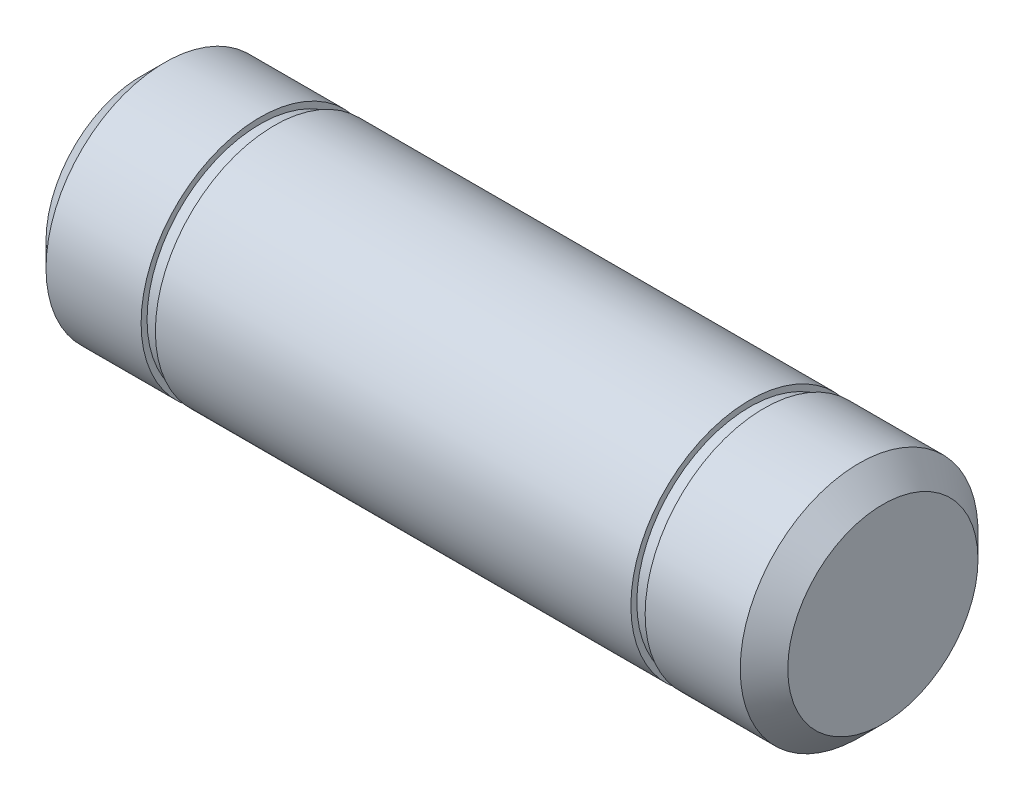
ISO-10303-21;
HEADER;
FILE_DESCRIPTION(('STEP AP214'),'2;1');
FILE_NAME('part.step','',(''),(''),'','','');
FILE_SCHEMA(('AUTOMOTIVE_DESIGN { 1 0 10303 214 1 1 1 1 }'));
ENDSEC;
DATA;
#1=APPLICATION_CONTEXT('core data for automotive mechanical design processes');
#2=APPLICATION_PROTOCOL_DEFINITION('international standard','automotive_design',2000,#1);
#3=PRODUCT_CONTEXT('',#1,'mechanical');
#4=PRODUCT('Part','Part','',(#3));
#5=PRODUCT_RELATED_PRODUCT_CATEGORY('part','',(#4));
#6=PRODUCT_DEFINITION_FORMATION('','',#4);
#7=PRODUCT_DEFINITION_CONTEXT('part definition',#1,'design');
#8=PRODUCT_DEFINITION('design','',#6,#7);
#9=PRODUCT_DEFINITION_SHAPE('','',#8);
#10=(LENGTH_UNIT() NAMED_UNIT(*) SI_UNIT(.MILLI.,.METRE.));
#11=(NAMED_UNIT(*) PLANE_ANGLE_UNIT() SI_UNIT($,.RADIAN.));
#12=(NAMED_UNIT(*) SI_UNIT($,.STERADIAN.) SOLID_ANGLE_UNIT());
#13=UNCERTAINTY_MEASURE_WITH_UNIT(LENGTH_MEASURE(1.E-05),#10,'distance_accuracy_value','');
#14=(GEOMETRIC_REPRESENTATION_CONTEXT(3) GLOBAL_UNCERTAINTY_ASSIGNED_CONTEXT((#13)) GLOBAL_UNIT_ASSIGNED_CONTEXT((#10,
#11,#12)) REPRESENTATION_CONTEXT('',''));
#15=CARTESIAN_POINT('',(0.,0.,0.));
#16=DIRECTION('',(0.,0.,1.));
#17=DIRECTION('',(1.,0.,0.));
#18=AXIS2_PLACEMENT_3D('',#15,#16,#17);
#19=CARTESIAN_POINT('',(-74.8924832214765,5.75154362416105,0.));
#20=DIRECTION('',(1.,0.,0.));
#21=DIRECTION('',(0.,0.,-1.));
#22=AXIS2_PLACEMENT_3D('',#19,#20,#21);
#23=PLANE('',#22);
#24=CARTESIAN_POINT('',(-74.8924832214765,5.75154362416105,0.));
#25=DIRECTION('',(1.,0.,0.));
#26=DIRECTION('',(0.,0.,-1.));
#27=AXIS2_PLACEMENT_3D('',#24,#25,#26);
#28=CIRCLE('',#27,7.99999999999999);
#29=CARTESIAN_POINT('',(-74.8924832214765,5.75154362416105,-7.99999999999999));
#30=VERTEX_POINT('',#29);
#31=EDGE_CURVE('E359',#30,#30,#28,.F.);
#32=ORIENTED_EDGE('',*,*,#31,.T.);
#33=EDGE_LOOP('',(#32));
#34=FACE_BOUND('',#33,.T.);
#35=ADVANCED_FACE('F353',(#34),#23,.F.);
#36=CARTESIAN_POINT('',(-112.89677852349,5.75154362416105,0.));
#37=DIRECTION('',(-1.,0.,0.));
#38=DIRECTION('',(0.,0.,1.));
#39=AXIS2_PLACEMENT_3D('',#36,#37,#38);
#40=CYLINDRICAL_SURFACE('',#39,10.);
#41=CARTESIAN_POINT('',(-72.8924832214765,5.75154362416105,0.));
#42=DIRECTION('',(1.,0.,0.));
#43=DIRECTION('',(0.,0.,-1.));
#44=AXIS2_PLACEMENT_3D('',#41,#42,#43);
#45=CIRCLE('',#44,10.);
#46=CARTESIAN_POINT('',(-72.8924832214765,5.75154362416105,-10.));
#47=VERTEX_POINT('',#46);
#48=EDGE_CURVE('E10',#47,#47,#45,.T.);
#49=ORIENTED_EDGE('',*,*,#48,.T.);
#50=EDGE_LOOP('',(#49));
#51=FACE_BOUND('',#50,.T.);
#52=CARTESIAN_POINT('',(-64.8924832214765,5.75154362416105,0.));
#53=DIRECTION('',(-1.,0.,0.));
#54=DIRECTION('',(0.,0.,1.));
#55=AXIS2_PLACEMENT_3D('',#52,#53,#54);
#56=CIRCLE('',#55,10.);
#57=CARTESIAN_POINT('',(-64.8924832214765,5.75154362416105,10.));
#58=VERTEX_POINT('',#57);
#59=EDGE_CURVE('E372',#58,#58,#56,.T.);
#60=ORIENTED_EDGE('',*,*,#59,.T.);
#61=EDGE_LOOP('',(#60));
#62=FACE_BOUND('',#61,.T.);
#63=ADVANCED_FACE('F415',(#51,#62),#40,.T.);
#64=CARTESIAN_POINT('',(-64.8924832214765,15.7515436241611,0.));
#65=DIRECTION('',(-1.,0.,0.));
#66=DIRECTION('',(0.,0.,1.));
#67=AXIS2_PLACEMENT_3D('',#64,#65,#66);
#68=PLANE('',#67);
#69=ORIENTED_EDGE('',*,*,#59,.F.);
#70=EDGE_LOOP('',(#69));
#71=FACE_BOUND('',#70,.T.);
#72=CARTESIAN_POINT('',(-64.8924832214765,5.75154362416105,0.));
#73=DIRECTION('',(-1.,0.,0.));
#74=DIRECTION('',(0.,0.,1.));
#75=AXIS2_PLACEMENT_3D('',#72,#73,#74);
#76=CIRCLE('',#75,9.5);
#77=CARTESIAN_POINT('',(-64.8924832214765,5.75154362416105,9.5));
#78=VERTEX_POINT('',#77);
#79=EDGE_CURVE('E375',#78,#78,#76,.T.);
#80=ORIENTED_EDGE('',*,*,#79,.T.);
#81=EDGE_LOOP('',(#80));
#82=FACE_BOUND('',#81,.T.);
#83=ADVANCED_FACE('F419',(#71,#82),#68,.F.);
#84=CARTESIAN_POINT('',(-112.89677852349,5.75154362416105,0.));
#85=DIRECTION('',(-1.,0.,0.));
#86=DIRECTION('',(0.,0.,1.));
#87=AXIS2_PLACEMENT_3D('',#84,#85,#86);
#88=CYLINDRICAL_SURFACE('',#87,9.5);
#89=ORIENTED_EDGE('',*,*,#79,.F.);
#90=EDGE_LOOP('',(#89));
#91=FACE_BOUND('',#90,.T.);
#92=CARTESIAN_POINT('',(-63.6924832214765,5.75154362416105,0.));
#93=DIRECTION('',(-1.,0.,0.));
#94=DIRECTION('',(0.,0.,1.));
#95=AXIS2_PLACEMENT_3D('',#92,#93,#94);
#96=CIRCLE('',#95,9.5);
#97=CARTESIAN_POINT('',(-63.6924832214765,5.75154362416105,9.5));
#98=VERTEX_POINT('',#97);
#99=EDGE_CURVE('E378',#98,#98,#96,.T.);
#100=ORIENTED_EDGE('',*,*,#99,.T.);
#101=EDGE_LOOP('',(#100));
#102=FACE_BOUND('',#101,.T.);
#103=ADVANCED_FACE('F423',(#91,#102),#88,.T.);
#104=CARTESIAN_POINT('',(-63.6924832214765,15.2515436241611,0.));
#105=DIRECTION('',(1.,0.,0.));
#106=DIRECTION('',(0.,0.,-1.));
#107=AXIS2_PLACEMENT_3D('',#104,#105,#106);
#108=PLANE('',#107);
#109=ORIENTED_EDGE('',*,*,#99,.F.);
#110=EDGE_LOOP('',(#109));
#111=FACE_BOUND('',#110,.T.);
#112=CARTESIAN_POINT('',(-63.6924832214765,5.75154362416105,0.));
#113=DIRECTION('',(-1.,0.,0.));
#114=DIRECTION('',(0.,0.,1.));
#115=AXIS2_PLACEMENT_3D('',#112,#113,#114);
#116=CIRCLE('',#115,10.);
#117=CARTESIAN_POINT('',(-63.6924832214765,5.75154362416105,10.));
#118=VERTEX_POINT('',#117);
#119=EDGE_CURVE('E381',#118,#118,#116,.T.);
#120=ORIENTED_EDGE('',*,*,#119,.T.);
#121=EDGE_LOOP('',(#120));
#122=FACE_BOUND('',#121,.T.);
#123=ADVANCED_FACE('F430',(#111,#122),#108,.F.);
#124=CARTESIAN_POINT('',(-112.89677852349,5.75154362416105,0.));
#125=DIRECTION('',(-1.,0.,0.));
#126=DIRECTION('',(0.,0.,1.));
#127=AXIS2_PLACEMENT_3D('',#124,#125,#126);
#128=CYLINDRICAL_SURFACE('',#127,10.);
#129=ORIENTED_EDGE('',*,*,#119,.F.);
#130=EDGE_LOOP('',(#129));
#131=FACE_BOUND('',#130,.T.);
#132=CARTESIAN_POINT('',(-23.6924832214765,5.75154362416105,0.));
#133=DIRECTION('',(-1.,0.,0.));
#134=DIRECTION('',(0.,0.,1.));
#135=AXIS2_PLACEMENT_3D('',#132,#133,#134);
#136=CIRCLE('',#135,10.);
#137=CARTESIAN_POINT('',(-23.6924832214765,5.75154362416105,10.));
#138=VERTEX_POINT('',#137);
#139=EDGE_CURVE('E384',#138,#138,#136,.T.);
#140=ORIENTED_EDGE('',*,*,#139,.T.);
#141=EDGE_LOOP('',(#140));
#142=FACE_BOUND('',#141,.T.);
#143=ADVANCED_FACE('F434',(#131,#142),#128,.T.);
#144=CARTESIAN_POINT('',(-23.6924832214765,15.7515436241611,0.));
#145=DIRECTION('',(-1.,0.,0.));
#146=DIRECTION('',(0.,0.,1.));
#147=AXIS2_PLACEMENT_3D('',#144,#145,#146);
#148=PLANE('',#147);
#149=ORIENTED_EDGE('',*,*,#139,.F.);
#150=EDGE_LOOP('',(#149));
#151=FACE_BOUND('',#150,.T.);
#152=CARTESIAN_POINT('',(-23.6924832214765,5.75154362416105,0.));
#153=DIRECTION('',(-1.,0.,0.));
#154=DIRECTION('',(0.,0.,1.));
#155=AXIS2_PLACEMENT_3D('',#152,#153,#154);
#156=CIRCLE('',#155,9.5);
#157=CARTESIAN_POINT('',(-23.6924832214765,5.75154362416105,9.5));
#158=VERTEX_POINT('',#157);
#159=EDGE_CURVE('E387',#158,#158,#156,.T.);
#160=ORIENTED_EDGE('',*,*,#159,.T.);
#161=EDGE_LOOP('',(#160));
#162=FACE_BOUND('',#161,.T.);
#163=ADVANCED_FACE('F438',(#151,#162),#148,.F.);
#164=CARTESIAN_POINT('',(-112.89677852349,5.75154362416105,0.));
#165=DIRECTION('',(-1.,0.,0.));
#166=DIRECTION('',(0.,0.,1.));
#167=AXIS2_PLACEMENT_3D('',#164,#165,#166);
#168=CYLINDRICAL_SURFACE('',#167,9.5);
#169=ORIENTED_EDGE('',*,*,#159,.F.);
#170=EDGE_LOOP('',(#169));
#171=FACE_BOUND('',#170,.T.);
#172=CARTESIAN_POINT('',(-22.4924832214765,5.75154362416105,0.));
#173=DIRECTION('',(-1.,0.,0.));
#174=DIRECTION('',(0.,0.,1.));
#175=AXIS2_PLACEMENT_3D('',#172,#173,#174);
#176=CIRCLE('',#175,9.5);
#177=CARTESIAN_POINT('',(-22.4924832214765,5.75154362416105,9.5));
#178=VERTEX_POINT('',#177);
#179=EDGE_CURVE('E390',#178,#178,#176,.T.);
#180=ORIENTED_EDGE('',*,*,#179,.T.);
#181=EDGE_LOOP('',(#180));
#182=FACE_BOUND('',#181,.T.);
#183=ADVANCED_FACE('F411',(#171,#182),#168,.T.);
#184=CARTESIAN_POINT('',(-22.4924832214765,15.2515436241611,0.));
#185=DIRECTION('',(1.,0.,0.));
#186=DIRECTION('',(0.,0.,-1.));
#187=AXIS2_PLACEMENT_3D('',#184,#185,#186);
#188=PLANE('',#187);
#189=ORIENTED_EDGE('',*,*,#179,.F.);
#190=EDGE_LOOP('',(#189));
#191=FACE_BOUND('',#190,.T.);
#192=CARTESIAN_POINT('',(-22.4924832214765,5.75154362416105,0.));
#193=DIRECTION('',(-1.,0.,0.));
#194=DIRECTION('',(0.,0.,1.));
#195=AXIS2_PLACEMENT_3D('',#192,#193,#194);
#196=CIRCLE('',#195,10.);
#197=CARTESIAN_POINT('',(-22.4924832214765,5.75154362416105,10.));
#198=VERTEX_POINT('',#197);
#199=EDGE_CURVE('E393',#198,#198,#196,.T.);
#200=ORIENTED_EDGE('',*,*,#199,.T.);
#201=EDGE_LOOP('',(#200));
#202=FACE_BOUND('',#201,.T.);
#203=ADVANCED_FACE('F397',(#191,#202),#188,.F.);
#204=CARTESIAN_POINT('',(-112.89677852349,5.75154362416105,0.));
#205=DIRECTION('',(-1.,0.,0.));
#206=DIRECTION('',(0.,0.,1.));
#207=AXIS2_PLACEMENT_3D('',#204,#205,#206);
#208=CYLINDRICAL_SURFACE('',#207,10.);
#209=CARTESIAN_POINT('',(-14.4924832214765,5.75154362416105,0.));
#210=DIRECTION('',(-1.,0.,0.));
#211=DIRECTION('',(0.,0.,1.));
#212=AXIS2_PLACEMENT_3D('',#209,#210,#211);
#213=CIRCLE('',#212,10.);
#214=CARTESIAN_POINT('',(-14.4924832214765,5.75154362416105,10.));
#215=VERTEX_POINT('',#214);
#216=EDGE_CURVE('E367',#215,#215,#213,.T.);
#217=ORIENTED_EDGE('',*,*,#216,.T.);
#218=EDGE_LOOP('',(#217));
#219=FACE_BOUND('',#218,.T.);
#220=ORIENTED_EDGE('',*,*,#199,.F.);
#221=EDGE_LOOP('',(#220));
#222=FACE_BOUND('',#221,.T.);
#223=ADVANCED_FACE('F399',(#219,#222),#208,.T.);
#224=CARTESIAN_POINT('',(-12.4924832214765,15.7515436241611,0.));
#225=DIRECTION('',(-1.,0.,0.));
#226=DIRECTION('',(0.,0.,1.));
#227=AXIS2_PLACEMENT_3D('',#224,#225,#226);
#228=PLANE('',#227);
#229=CARTESIAN_POINT('',(-12.4924832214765,5.75154362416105,0.));
#230=DIRECTION('',(-1.,0.,0.));
#231=DIRECTION('',(0.,0.,1.));
#232=AXIS2_PLACEMENT_3D('',#229,#230,#231);
#233=CIRCLE('',#232,7.99999999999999);
#234=CARTESIAN_POINT('',(-12.4924832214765,5.75154362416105,7.99999999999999));
#235=VERTEX_POINT('',#234);
#236=EDGE_CURVE('E363',#235,#235,#233,.F.);
#237=ORIENTED_EDGE('',*,*,#236,.T.);
#238=EDGE_LOOP('',(#237));
#239=FACE_BOUND('',#238,.T.);
#240=ADVANCED_FACE('F401',(#239),#228,.F.);
#241=CARTESIAN_POINT('',(-14.4924832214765,5.75154362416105,0.));
#242=DIRECTION('',(-1.,0.,0.));
#243=DIRECTION('',(0.,0.,1.));
#244=AXIS2_PLACEMENT_3D('',#241,#242,#243);
#245=CONICAL_SURFACE('',#244,10.,0.78539816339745);
#246=ORIENTED_EDGE('',*,*,#236,.F.);
#247=EDGE_LOOP('',(#246));
#248=FACE_BOUND('',#247,.T.);
#249=ORIENTED_EDGE('',*,*,#216,.F.);
#250=EDGE_LOOP('',(#249));
#251=FACE_BOUND('',#250,.T.);
#252=ADVANCED_FACE('F408',(#248,#251),#245,.T.);
#253=CARTESIAN_POINT('',(-74.8924832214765,5.75154362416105,0.));
#254=DIRECTION('',(1.,0.,0.));
#255=DIRECTION('',(0.,0.,-1.));
#256=AXIS2_PLACEMENT_3D('',#253,#254,#255);
#257=CONICAL_SURFACE('',#256,7.99999999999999,0.785398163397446);
#258=ORIENTED_EDGE('',*,*,#48,.F.);
#259=EDGE_LOOP('',(#258));
#260=FACE_BOUND('',#259,.T.);
#261=ORIENTED_EDGE('',*,*,#31,.F.);
#262=EDGE_LOOP('',(#261));
#263=FACE_BOUND('',#262,.T.);
#264=ADVANCED_FACE('F470',(#260,#263),#257,.T.);
#265=CLOSED_SHELL('',(#35,#63,#83,#103,#123,#143,#163,#183,#203,#223,#240,#252,#264));
#266=MANIFOLD_SOLID_BREP('B2',#265);
#267=ADVANCED_BREP_SHAPE_REPRESENTATION('',(#18,#266),#14);
#268=SHAPE_DEFINITION_REPRESENTATION(#9,#267);
ENDSEC;
END-ISO-10303-21;
